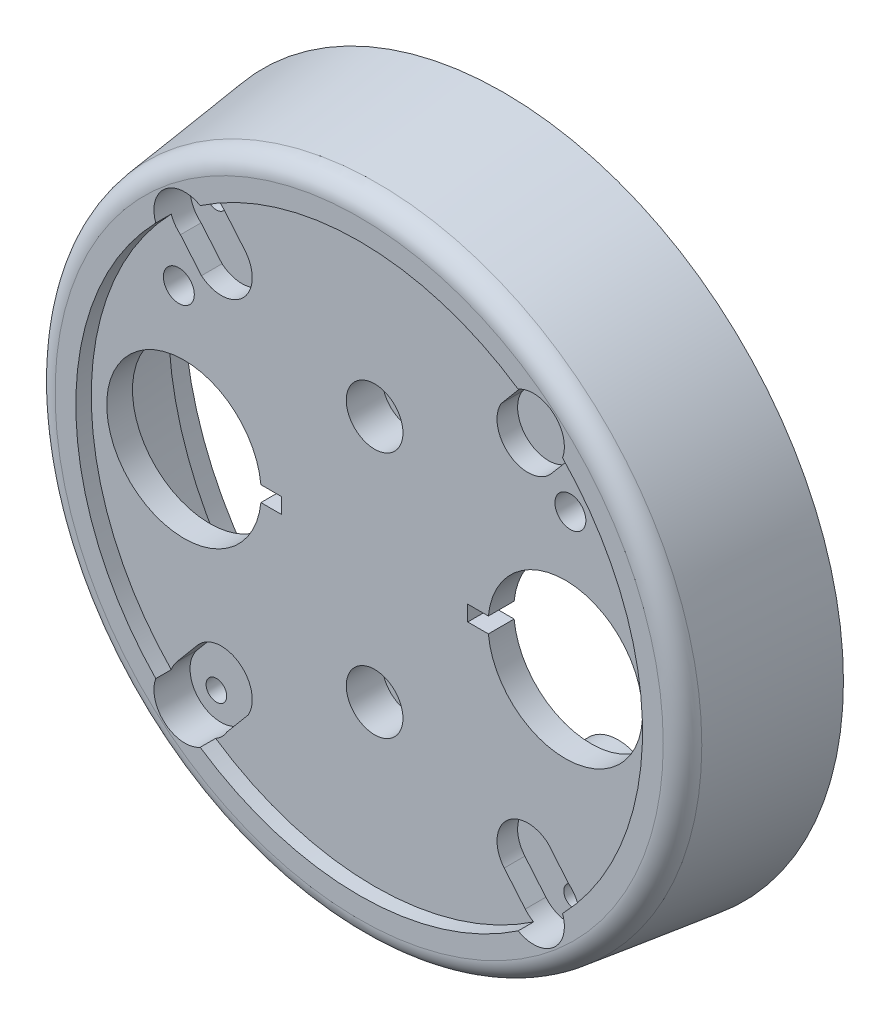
from build123d import *

# Parameters (mm, degrees)
ESQUISSE1_R                                       = 33
EXTRUSION1_DEPTH                                  = 14
EXTRUSION1_TAPER                                  = 7
CONG_1_R                                          = 2
ESQUISSE2_R                                       = 27.5
ENL_V_MAT_EXTRU_1_DEPTH                           = 1.5
ESQUISSE3_R                                       = 31
ENL_V_MAT_EXTRU_2_DEPTH                           = 2.5
ESQUISSE4_R                                       = 30
ENL_V_MAT_EXTRU_3_DEPTH                           = 7.5
ENL_V_MAT_EXTRU_3_DRAFT                           = -5
EXTRUSION2_DEPTH                                  = 7
R_P_TITION_CIRCULAIRE1_COUNT                      = 2
R_P_TITION_CIRCULAIRE1_ANGLE                      = 100
R_P_TITION_CIRCULAIRE2_COUNT                      = 2
R_P_TITION_CIRCULAIRE2_ANGLE                      = 80
R_P_TITION_CIRCULAIRE3_COUNT                      = 2
ESQUISSE6_R                                       = 1
ENL_V_MAT_EXTRU_4_DEPTH                           = 48.947888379
R_P_TITION_CIRCULAIRE4_COUNT                      = 2
R_P_TITION_CIRCULAIRE4_ANGLE                      = 100
R_P_TITION_CIRCULAIRE5_COUNT                      = 2
R_P_TITION_CIRCULAIRE5_ANGLE                      = 80
R_P_TITION_CIRCULAIRE6_COUNT                      = 2
ENL_V_MAT_EXTRU_5_DEPTH                           = 48.728398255
ESQUISSE8_R                                       = 4.25
EXTRUSION3_DEPTH                                  = 6
CHAMBRAGE_POUR_VIS_T_TE_HEXAGONALE_M2_D           = 2.9
CHAMBRAGE_POUR_VIS_T_TE_HEXAGONALE_M2_CBORE_D     = 5.5
CHAMBRAGE_POUR_VIS_T_TE_HEXAGONALE_M2_CBORE_DEPTH = 3.5
ENL_V_MAT_EXTRU_6_DEPTH                           = 3.5
R_P_TITION_CIRCULAIRE7_COUNT                      = 2
R_P_TITION_CIRCULAIRE7_ANGLE                      = 100
R_P_TITION_CIRCULAIRE8_COUNT                      = 2
R_P_TITION_CIRCULAIRE9_COUNT                      = 2
R_P_TITION_CIRCULAIRE9_ANGLE                      = 80
ESQUISSE13_R                                      = 1.5
ENL_V_MAT_EXTRU_7_DEPTH                           = 49.314076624


with BuildPart() as part:
    # Esquisse1 → Extrusion1 (new body)
    with BuildSketch(Plane.XY):
        Circle(ESQUISSE1_R)
    extrude(amount=EXTRUSION1_DEPTH, taper=EXTRUSION1_TAPER)

    # Cong_1
    cong_1_edges = [part.edges().sort_by_distance(p)[0] for p in [
        (-31.281016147, 0, 14),
    ]]
    fillet(cong_1_edges, radius=CONG_1_R)

    # Esquisse2 → Enl_v. mat.-Extru.1 (cut)
    with BuildSketch(Plane.XY.offset(14)):
        Circle(ESQUISSE2_R)
    extrude(amount=-ENL_V_MAT_EXTRU_1_DEPTH, mode=Mode.SUBTRACT)

    # Esquisse3 → Enl_v. mat.-Extru.2 (cut)
    with BuildSketch(Plane(origin=(0, 0, 0), x_dir=(-1, 0, 0), z_dir=(0, 0, -1))):
        Circle(ESQUISSE3_R)
    extrude(amount=-ENL_V_MAT_EXTRU_2_DEPTH, mode=Mode.SUBTRACT)


with BuildPart() as enl_v_mat_extru_3_tool:
    # Esquisse4 → Enl_v. mat.-Extru.3 (with draft: the straight prism first)
    with BuildSketch(Plane(origin=(0, 0, 2.5), x_dir=(-1, 0, 0), z_dir=(0, 0, -1))):
        Circle(ESQUISSE4_R)
    extrude(amount=-ENL_V_MAT_EXTRU_3_DEPTH)
    # Enl_v. mat.-Extru.3: the draft: its side faces are tilted about the plane it starts from
    enl_v_mat_extru_3_sides = [enl_v_mat_extru_3_tool.faces().sort_by_distance(p)[0] for p in [
        (30, 0, 6.25),
    ]]
    draft(enl_v_mat_extru_3_sides, Plane(origin=(0, 0, 2.5), x_dir=(-1, 0, 0), z_dir=(0, 0, -1)), ENL_V_MAT_EXTRU_3_DRAFT)


with BuildPart() as part_1:
    add(part.part)

    # Enl_v. mat.-Extru.3: cut by enl_v_mat_extru_3_tool
    add(enl_v_mat_extru_3_tool.part, mode=Mode.SUBTRACT)

    # Esquisse5 → Extrusion2 (add)
    with BuildSketch(Plane(origin=(0, 0, 10), x_dir=(-1, 0, 0), z_dir=(0, 0, -1))):
        with BuildLine():
            Line((-17.205505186, 14.28182731), (-22.824016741, 20.977708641))
            Line((-22.824016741, 20.977708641), (-16.695661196, 26.120009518))
            Line((-16.695661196, 26.120009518), (-11.077149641, 19.424128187))
            ThreePointArc((-11.077149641, 19.424128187), (-11.570176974, 13.788799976), (-17.205505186, 14.28182731))
        make_face()
    extrusion2 = extrude(amount=EXTRUSION2_DEPTH)

    # R_p_tition circulaire1: Extrusion2 ×2 about axis
    r_p_tition_circulaire1_axis = Axis((0, 0, 0), (0, 0, -1))
    for i in range(1, R_P_TITION_CIRCULAIRE1_COUNT):
        add(extrusion2.rotate(r_p_tition_circulaire1_axis, i * R_P_TITION_CIRCULAIRE1_ANGLE / (R_P_TITION_CIRCULAIRE1_COUNT - 1)))

    # R_p_tition circulaire2: Extrusion2 ×2 about axis
    r_p_tition_circulaire2_axis = Axis((0, 0, 0), (0, 0, 1))
    for i in range(1, R_P_TITION_CIRCULAIRE2_COUNT):
        add(extrusion2.rotate(r_p_tition_circulaire2_axis, i * R_P_TITION_CIRCULAIRE2_ANGLE / (R_P_TITION_CIRCULAIRE2_COUNT - 1)))

    # R_p_tition circulaire3: Extrusion2 ×2 about axis
    r_p_tition_circulaire3_axis = Axis((0, 0, 0), (0, 0, 1))
    for i in range(1, R_P_TITION_CIRCULAIRE3_COUNT):
        add(extrusion2.rotate(r_p_tition_circulaire3_axis, i * 360 / R_P_TITION_CIRCULAIRE3_COUNT))

    # Esquisse6 → Enl_v. mat.-Extru.4 (cut, through all)
    with BuildSketch(Plane(origin=(0, 0, 3), x_dir=(-1, 0, 0), z_dir=(0, 0, -1))):
        with Locations((-17.355265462, 20.683199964)):
            Circle(ESQUISSE6_R)
    enl_v_mat_extru_4 = extrude(amount=-ENL_V_MAT_EXTRU_4_DEPTH, mode=Mode.SUBTRACT)

    # R_p_tition circulaire4: Enl_v. mat.-Extru.4 ×2 about axis
    r_p_tition_circulaire4_axis = Axis((0, 0, 2.5), (0, 0, -1))
    for i in range(1, R_P_TITION_CIRCULAIRE4_COUNT):
        add(enl_v_mat_extru_4.rotate(r_p_tition_circulaire4_axis, i * R_P_TITION_CIRCULAIRE4_ANGLE / (R_P_TITION_CIRCULAIRE4_COUNT - 1)), mode=Mode.SUBTRACT)

    # R_p_tition circulaire5: Enl_v. mat.-Extru.4 ×2 about axis
    r_p_tition_circulaire5_axis = Axis((0, 0, 2.5), (0, 0, 1))
    for i in range(1, R_P_TITION_CIRCULAIRE5_COUNT):
        add(enl_v_mat_extru_4.rotate(r_p_tition_circulaire5_axis, i * R_P_TITION_CIRCULAIRE5_ANGLE / (R_P_TITION_CIRCULAIRE5_COUNT - 1)), mode=Mode.SUBTRACT)

    # R_p_tition circulaire6: Enl_v. mat.-Extru.4 ×2 about axis
    r_p_tition_circulaire6_axis = Axis((0, 0, 0), (0, 0, 1))
    for i in range(1, R_P_TITION_CIRCULAIRE6_COUNT):
        add(enl_v_mat_extru_4.rotate(r_p_tition_circulaire6_axis, i * 360 / R_P_TITION_CIRCULAIRE6_COUNT), mode=Mode.SUBTRACT)

    # Esquisse7 → Enl_v. mat.-Extru.5 (cut, through all)
    with BuildSketch(Plane(origin=(0, 0, 10), x_dir=(-1, 0, 0), z_dir=(0, 0, -1))):
        with BuildLine():
            Line((-11.037594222, 0.75), (-9.037594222, 0.75))
            Line((-9.037594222, 0.75), (-9.037594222, -0.75))
            Line((-9.037594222, -0.75), (-11.037594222, -0.75))
            ThreePointArc((-11.037594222, -0.75), (-26, 0), (-11.037594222, 0.75))
        make_face()
        with BuildLine():
            Line((9.037594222, 0.75), (11.037594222, 0.75))
            ThreePointArc((11.037594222, 0.75), (26, 0), (11.037594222, -0.75))
            Line((11.037594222, -0.75), (9.037594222, -0.75))
            Line((9.037594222, -0.75), (9.037594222, 0.75))
        make_face()
    extrude(amount=-ENL_V_MAT_EXTRU_5_DEPTH, mode=Mode.SUBTRACT)

    # Esquisse8 → Extrusion3 (add)
    with BuildSketch(Plane(origin=(0, 0, 10), x_dir=(-1, 0, 0), z_dir=(0, 0, -1))):
        with Locations((0, 12)):
            Circle(ESQUISSE8_R)
        with Locations((0, -12)):
            Circle(ESQUISSE8_R)
    extrude(amount=EXTRUSION3_DEPTH)

    # Chambrage pour vis _ t_te hexagonale M2 (through all)
    with Locations(Plane.XY.offset(12.5)):
        with Locations((0, 12), (0, -12)):
            CounterBoreHole(CHAMBRAGE_POUR_VIS_T_TE_HEXAGONALE_M2_D / 2, CHAMBRAGE_POUR_VIS_T_TE_HEXAGONALE_M2_CBORE_D / 2, CHAMBRAGE_POUR_VIS_T_TE_HEXAGONALE_M2_CBORE_DEPTH)

    # Esquisse12 → Enl_v. mat.-Extru.6 (cut)
    with BuildSketch(Plane.XY.offset(14)):
        with BuildLine():
            Line((-14.617793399, 22.087979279), (-12.5786219, 19.65778932))
            ThreePointArc((-12.5786219, 19.65778932), (-12.755434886, 15.608106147), (-16.805118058, 15.431293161))
            Line((-16.805118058, 15.431293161), (-18.844289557, 17.861483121))
            ThreePointArc((-18.844289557, 17.861483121), (-19.037247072, 22.280936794), (-14.617793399, 22.087979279))
        make_face()
    enl_v_mat_extru_6 = extrude(amount=-ENL_V_MAT_EXTRU_6_DEPTH, mode=Mode.SUBTRACT)

    # R_p_tition circulaire7: Enl_v. mat.-Extru.6 ×2 about axis
    r_p_tition_circulaire7_axis = Axis((0, 0, 0), (0, 0, 1))
    for i in range(1, R_P_TITION_CIRCULAIRE7_COUNT):
        add(enl_v_mat_extru_6.rotate(r_p_tition_circulaire7_axis, i * R_P_TITION_CIRCULAIRE7_ANGLE / (R_P_TITION_CIRCULAIRE7_COUNT - 1)), mode=Mode.SUBTRACT)

    # R_p_tition circulaire8: Enl_v. mat.-Extru.6 ×2 about axis
    r_p_tition_circulaire8_axis = Axis((0, 0, 0), (0, 0, 1))
    for i in range(1, R_P_TITION_CIRCULAIRE8_COUNT):
        add(enl_v_mat_extru_6.rotate(r_p_tition_circulaire8_axis, i * 360 / R_P_TITION_CIRCULAIRE8_COUNT), mode=Mode.SUBTRACT)

    # R_p_tition circulaire9: Enl_v. mat.-Extru.6 ×2 about axis
    r_p_tition_circulaire9_axis = Axis((0, 0, 0), (0, 0, -1))
    for i in range(1, R_P_TITION_CIRCULAIRE9_COUNT):
        add(enl_v_mat_extru_6.rotate(r_p_tition_circulaire9_axis, i * R_P_TITION_CIRCULAIRE9_ANGLE / (R_P_TITION_CIRCULAIRE9_COUNT - 1)), mode=Mode.SUBTRACT)

    # Esquisse13 → Enl_v. mat.-Extru.7 (cut, through all)
    with BuildSketch(Plane.XY.offset(12.5)):
        with Locations((-19, 13.5)):
            Circle(ESQUISSE13_R)
        with Locations((19, 13.5)):
            Circle(ESQUISSE13_R)
    extrude(amount=-ENL_V_MAT_EXTRU_7_DEPTH, mode=Mode.SUBTRACT)


solid = part_1.part
